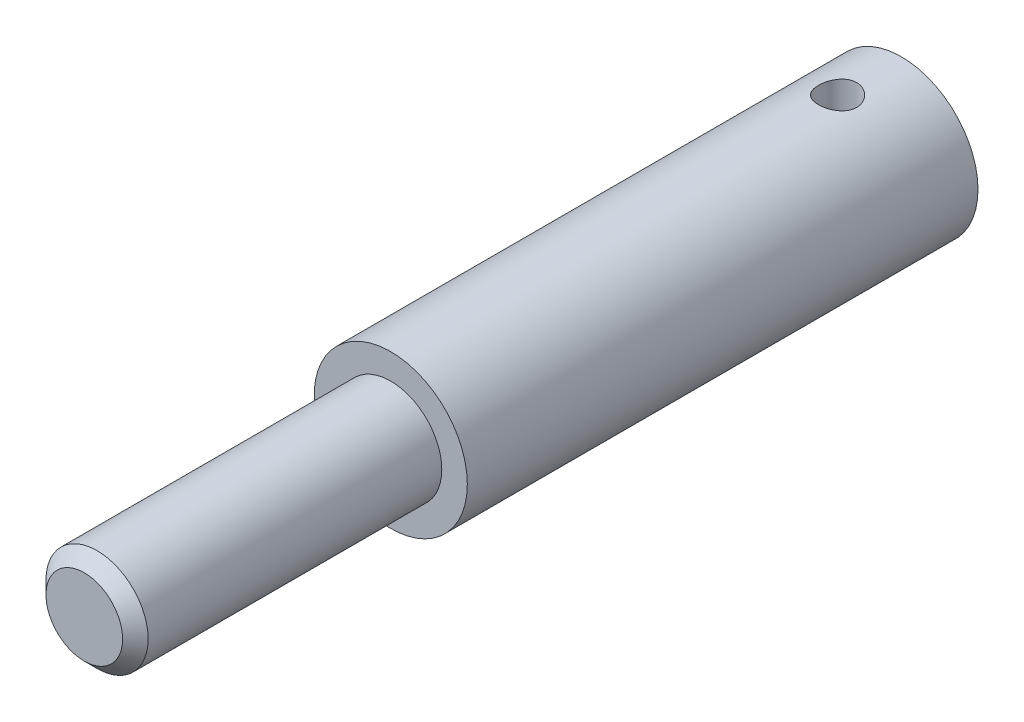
ISO-10303-21;
HEADER;
FILE_DESCRIPTION(('STEP AP214'),'2;1');
FILE_NAME('part.step','',(''),(''),'','','');
FILE_SCHEMA(('AUTOMOTIVE_DESIGN { 1 0 10303 214 1 1 1 1 }'));
ENDSEC;
DATA;
#1=APPLICATION_CONTEXT('core data for automotive mechanical design processes');
#2=APPLICATION_PROTOCOL_DEFINITION('international standard','automotive_design',2000,#1);
#3=PRODUCT_CONTEXT('',#1,'mechanical');
#4=PRODUCT('Part','Part','',(#3));
#5=PRODUCT_RELATED_PRODUCT_CATEGORY('part','',(#4));
#6=PRODUCT_DEFINITION_FORMATION('','',#4);
#7=PRODUCT_DEFINITION_CONTEXT('part definition',#1,'design');
#8=PRODUCT_DEFINITION('design','',#6,#7);
#9=PRODUCT_DEFINITION_SHAPE('','',#8);
#10=(LENGTH_UNIT() NAMED_UNIT(*) SI_UNIT(.MILLI.,.METRE.));
#11=(NAMED_UNIT(*) PLANE_ANGLE_UNIT() SI_UNIT($,.RADIAN.));
#12=(NAMED_UNIT(*) SI_UNIT($,.STERADIAN.) SOLID_ANGLE_UNIT());
#13=UNCERTAINTY_MEASURE_WITH_UNIT(LENGTH_MEASURE(1.E-05),#10,'distance_accuracy_value','');
#14=(GEOMETRIC_REPRESENTATION_CONTEXT(3) GLOBAL_UNCERTAINTY_ASSIGNED_CONTEXT((#13)) GLOBAL_UNIT_ASSIGNED_CONTEXT((#10,
#11,#12)) REPRESENTATION_CONTEXT('',''));
#15=CARTESIAN_POINT('',(0.,0.,0.));
#16=DIRECTION('',(0.,0.,1.));
#17=DIRECTION('',(1.,0.,0.));
#18=AXIS2_PLACEMENT_3D('',#15,#16,#17);
#19=CARTESIAN_POINT('',(0.,0.,40.));
#20=DIRECTION('',(0.,0.,1.));
#21=DIRECTION('',(1.,0.,0.));
#22=AXIS2_PLACEMENT_3D('',#19,#20,#21);
#23=PLANE('',#22);
#24=CARTESIAN_POINT('',(0.,0.,40.));
#25=DIRECTION('',(0.,0.,1.));
#26=DIRECTION('',(1.,0.,0.));
#27=AXIS2_PLACEMENT_3D('',#24,#25,#26);
#28=CIRCLE('',#27,6.);
#29=CARTESIAN_POINT('',(6.,0.,40.));
#30=VERTEX_POINT('',#29);
#31=EDGE_CURVE('E49',#30,#30,#28,.T.);
#32=ORIENTED_EDGE('',*,*,#31,.T.);
#33=EDGE_LOOP('',(#32));
#34=FACE_BOUND('',#33,.T.);
#35=CARTESIAN_POINT('',(0.,0.,40.));
#36=DIRECTION('',(0.,0.,1.));
#37=DIRECTION('',(1.,0.,0.));
#38=AXIS2_PLACEMENT_3D('',#35,#36,#37);
#39=CIRCLE('',#38,4.);
#40=CARTESIAN_POINT('',(4.,0.,40.));
#41=VERTEX_POINT('',#40);
#42=EDGE_CURVE('E85',#41,#41,#39,.T.);
#43=ORIENTED_EDGE('',*,*,#42,.F.);
#44=EDGE_LOOP('',(#43));
#45=FACE_BOUND('',#44,.T.);
#46=ADVANCED_FACE('F33',(#34,#45),#23,.T.);
#47=CARTESIAN_POINT('',(0.,0.,40.));
#48=DIRECTION('',(0.,0.,-1.));
#49=DIRECTION('',(-1.,0.,0.));
#50=AXIS2_PLACEMENT_3D('',#47,#48,#49);
#51=CYLINDRICAL_SURFACE('',#50,6.);
#52=CARTESIAN_POINT('',(0.,-6.,6.5));
#53=CARTESIAN_POINT('',(0.0828760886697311,-5.99999859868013,6.49999767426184));
#54=CARTESIAN_POINT('',(0.165778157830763,-5.99826578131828,6.49310844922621));
#55=CARTESIAN_POINT('',(0.329206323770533,-5.99152113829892,6.465774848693));
#56=CARTESIAN_POINT('',(0.409731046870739,-5.98650745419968,6.44532279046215));
#57=CARTESIAN_POINT('',(0.566020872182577,-5.9737562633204,6.39156074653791));
#58=CARTESIAN_POINT('',(0.641791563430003,-5.96602202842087,6.35826620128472));
#59=CARTESIAN_POINT('',(0.786672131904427,-5.94865343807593,6.27981860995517));
#60=CARTESIAN_POINT('',(0.855781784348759,-5.9390190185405,6.23466516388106));
#61=CARTESIAN_POINT('',(0.98680192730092,-5.91867413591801,6.13279921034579));
#62=CARTESIAN_POINT('',(1.04855569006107,-5.90794707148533,6.07588842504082));
#63=CARTESIAN_POINT('',(1.1617489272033,-5.8867362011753,5.95254779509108));
#64=CARTESIAN_POINT('',(1.21318723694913,-5.87625242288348,5.8861168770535));
#65=CARTESIAN_POINT('',(1.30502654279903,-5.8565477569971,5.74440477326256));
#66=CARTESIAN_POINT('',(1.34525221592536,-5.84734794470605,5.6690067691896));
#67=CARTESIAN_POINT('',(1.41239690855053,-5.83149494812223,5.51225158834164));
#68=CARTESIAN_POINT('',(1.43931805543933,-5.82484135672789,5.43089536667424));
#69=CARTESIAN_POINT('',(1.47855483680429,-5.81500476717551,5.26625650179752));
#70=CARTESIAN_POINT('',(1.49115226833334,-5.81175491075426,5.1830451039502));
#71=CARTESIAN_POINT('',(1.50226177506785,-5.80889362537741,5.01563143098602));
#72=CARTESIAN_POINT('',(1.50077614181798,-5.80928160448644,4.93142931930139));
#73=CARTESIAN_POINT('',(1.48398652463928,-5.81359205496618,4.76658419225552));
#74=CARTESIAN_POINT('',(1.46901834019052,-5.81742863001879,4.6859043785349));
#75=CARTESIAN_POINT('',(1.42622418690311,-5.82806709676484,4.52823894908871));
#76=CARTESIAN_POINT('',(1.39839730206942,-5.83486919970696,4.45125359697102));
#77=CARTESIAN_POINT('',(1.33038947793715,-5.85075113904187,4.30226198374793));
#78=CARTESIAN_POINT('',(1.29008666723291,-5.85985327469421,4.23031382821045));
#79=CARTESIAN_POINT('',(1.19835627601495,-5.87929710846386,4.09408129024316));
#80=CARTESIAN_POINT('',(1.14692674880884,-5.88963902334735,4.02979825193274));
#81=CARTESIAN_POINT('',(1.03266342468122,-5.91075880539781,3.9087963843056));
#82=CARTESIAN_POINT('',(0.96954625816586,-5.92154069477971,3.85234550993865));
#83=CARTESIAN_POINT('',(0.8346119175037,-5.94205965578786,3.7507787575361));
#84=CARTESIAN_POINT('',(0.762794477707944,-5.95179669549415,3.70566322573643));
#85=CARTESIAN_POINT('',(0.612115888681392,-5.96917732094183,3.62794941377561));
#86=CARTESIAN_POINT('',(0.533231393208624,-5.97681360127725,3.59539465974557));
#87=CARTESIAN_POINT('',(0.370876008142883,-5.98907916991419,3.54408269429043));
#88=CARTESIAN_POINT('',(0.287405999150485,-5.99370903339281,3.52532284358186));
#89=CARTESIAN_POINT('',(0.120539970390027,-5.99935499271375,3.50254243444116));
#90=CARTESIAN_POINT('',(0.0371967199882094,-6.00046053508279,3.4981569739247));
#91=CARTESIAN_POINT('',(-0.129032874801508,-5.99918804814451,3.50324900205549));
#92=CARTESIAN_POINT('',(-0.211919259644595,-5.99681033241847,3.51272524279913));
#93=CARTESIAN_POINT('',(-0.373614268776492,-5.98889581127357,3.54497090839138));
#94=CARTESIAN_POINT('',(-0.452465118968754,-5.98340634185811,3.56754126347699));
#95=CARTESIAN_POINT('',(-0.605257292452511,-5.96988706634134,3.62510708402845));
#96=CARTESIAN_POINT('',(-0.679198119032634,-5.96185700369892,3.66010380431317));
#97=CARTESIAN_POINT('',(-0.821523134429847,-5.94393307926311,3.74223612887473));
#98=CARTESIAN_POINT('',(-0.88978544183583,-5.93400867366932,3.78957611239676));
#99=CARTESIAN_POINT('',(-1.01752661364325,-5.91344509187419,3.89478990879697));
#100=CARTESIAN_POINT('',(-1.07700395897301,-5.90280579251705,3.95266553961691));
#101=CARTESIAN_POINT('',(-1.18699056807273,-5.88168956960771,4.07900196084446));
#102=CARTESIAN_POINT('',(-1.23724386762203,-5.87122304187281,4.14768770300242));
#103=CARTESIAN_POINT('',(-1.3255107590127,-5.85192878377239,4.29273263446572));
#104=CARTESIAN_POINT('',(-1.36352489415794,-5.84310098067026,4.36909148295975));
#105=CARTESIAN_POINT('',(-1.42595142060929,-5.82818094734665,4.52690572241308));
#106=CARTESIAN_POINT('',(-1.45044439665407,-5.82207255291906,4.60832762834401));
#107=CARTESIAN_POINT('',(-1.48534565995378,-5.81326744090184,4.77430963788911));
#108=CARTESIAN_POINT('',(-1.49575702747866,-5.81056997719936,4.85886905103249));
#109=CARTESIAN_POINT('',(-1.50203859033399,-5.80894901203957,5.0261210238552));
#110=CARTESIAN_POINT('',(-1.49831789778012,-5.80991932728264,5.10879743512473));
#111=CARTESIAN_POINT('',(-1.47737727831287,-5.81527909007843,5.27230388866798));
#112=CARTESIAN_POINT('',(-1.46015762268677,-5.81966846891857,5.35313396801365));
#113=CARTESIAN_POINT('',(-1.41293131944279,-5.83131260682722,5.51020845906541));
#114=CARTESIAN_POINT('',(-1.38300140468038,-5.83855015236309,5.58647730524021));
#115=CARTESIAN_POINT('',(-1.31126491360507,-5.85507755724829,5.73296538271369));
#116=CARTESIAN_POINT('',(-1.26945669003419,-5.86436770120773,5.80318377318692));
#117=CARTESIAN_POINT('',(-1.17386774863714,-5.88425634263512,5.93755462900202));
#118=CARTESIAN_POINT('',(-1.11980316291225,-5.89488264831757,6.00150107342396));
#119=CARTESIAN_POINT('',(-1.00178937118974,-5.91608027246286,6.11954704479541));
#120=CARTESIAN_POINT('',(-0.937837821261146,-5.9266515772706,6.17364423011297));
#121=CARTESIAN_POINT('',(-0.80046758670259,-5.94677655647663,6.27141130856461));
#122=CARTESIAN_POINT('',(-0.726898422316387,-5.95630833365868,6.31487461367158));
#123=CARTESIAN_POINT('',(-0.573266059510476,-5.97304924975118,6.38874746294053));
#124=CARTESIAN_POINT('',(-0.493207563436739,-5.98026005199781,6.41916636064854));
#125=CARTESIAN_POINT('',(-0.344410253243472,-5.99048059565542,6.46157183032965));
#126=CARTESIAN_POINT('',(-0.276380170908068,-5.99402585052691,6.47595124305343));
#127=CARTESIAN_POINT('',(-0.138906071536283,-5.99878605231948,6.49516594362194));
#128=CARTESIAN_POINT('',(-0.0694621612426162,-6.00000117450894,6.5000019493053));
#129=CARTESIAN_POINT('',(0.,-6.,6.5));
#130=B_SPLINE_CURVE_WITH_KNOTS('',3,(#52,#53,#54,#55,#56,#57,#58,#59,#60,#61,#62,#63,#64,#65,
#66,#67,#68,#69,#70,#71,#72,#73,#74,#75,#76,#77,#78,#79,#80,#81,#82,#83,#84,#85,#86,#87,#88,#89,
#90,#91,#92,#93,#94,#95,#96,#97,#98,#99,#100,#101,#102,#103,#104,#105,#106,#107,#108,#109,#110,
#111,#112,#113,#114,#115,#116,#117,#118,#119,#120,#121,#122,#123,#124,#125,#126,#127,#128,#129),
.UNSPECIFIED.,.T.,.F.,(4,2,2,2,2,2,2,2,2,2,2,2,2,2,2,2,2,2,2,2,2,2,2,2,2,2,2,2,2,2,2,2,2,2,2,2,
2,2,4),(0.,0.24837371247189,0.4968882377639,0.745104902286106,0.993329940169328,
1.24614435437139,1.49898729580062,1.75558647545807,2.01214461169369,2.2635629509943,
2.51494038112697,2.76022497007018,3.00552703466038,3.25330527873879,3.50112690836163,
3.75601500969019,4.01091089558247,4.26668229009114,4.52240473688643,4.77158308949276,
5.02073901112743,5.26620274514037,5.5116912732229,5.76153587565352,6.01142363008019,
6.26744509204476,6.52345518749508,6.77792254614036,7.03233423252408,7.27943780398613,
7.52653640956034,7.77216400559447,8.01782568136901,8.2698957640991,8.52202569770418,
8.77872185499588,9.0352336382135,9.24342242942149,9.4515955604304),.UNSPECIFIED.);
#131=CARTESIAN_POINT('',(0.,-6.,6.5));
#132=VERTEX_POINT('',#131);
#133=EDGE_CURVE('E37',#132,#132,#130,.T.);
#134=ORIENTED_EDGE('',*,*,#133,.T.);
#135=EDGE_LOOP('',(#134));
#136=FACE_BOUND('',#135,.T.);
#137=CARTESIAN_POINT('',(0.,6.,6.5));
#138=CARTESIAN_POINT('',(-0.0828760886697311,5.99999859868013,6.49999767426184));
#139=CARTESIAN_POINT('',(-0.165778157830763,5.99826578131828,6.49310844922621));
#140=CARTESIAN_POINT('',(-0.329206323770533,5.99152113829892,6.465774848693));
#141=CARTESIAN_POINT('',(-0.409731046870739,5.98650745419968,6.44532279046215));
#142=CARTESIAN_POINT('',(-0.566020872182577,5.9737562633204,6.39156074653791));
#143=CARTESIAN_POINT('',(-0.641791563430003,5.96602202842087,6.35826620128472));
#144=CARTESIAN_POINT('',(-0.786672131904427,5.94865343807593,6.27981860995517));
#145=CARTESIAN_POINT('',(-0.855781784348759,5.9390190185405,6.23466516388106));
#146=CARTESIAN_POINT('',(-0.98680192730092,5.91867413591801,6.13279921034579));
#147=CARTESIAN_POINT('',(-1.04855569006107,5.90794707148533,6.07588842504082));
#148=CARTESIAN_POINT('',(-1.1617489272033,5.8867362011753,5.95254779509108));
#149=CARTESIAN_POINT('',(-1.21318723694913,5.87625242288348,5.8861168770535));
#150=CARTESIAN_POINT('',(-1.30502654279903,5.8565477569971,5.74440477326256));
#151=CARTESIAN_POINT('',(-1.34525221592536,5.84734794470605,5.6690067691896));
#152=CARTESIAN_POINT('',(-1.41239690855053,5.83149494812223,5.51225158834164));
#153=CARTESIAN_POINT('',(-1.43931805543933,5.82484135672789,5.43089536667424));
#154=CARTESIAN_POINT('',(-1.47855483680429,5.81500476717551,5.26625650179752));
#155=CARTESIAN_POINT('',(-1.49115226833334,5.81175491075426,5.1830451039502));
#156=CARTESIAN_POINT('',(-1.50226177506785,5.80889362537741,5.01563143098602));
#157=CARTESIAN_POINT('',(-1.50077614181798,5.80928160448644,4.93142931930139));
#158=CARTESIAN_POINT('',(-1.48398652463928,5.81359205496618,4.76658419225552));
#159=CARTESIAN_POINT('',(-1.46901834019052,5.81742863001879,4.6859043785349));
#160=CARTESIAN_POINT('',(-1.42622418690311,5.82806709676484,4.52823894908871));
#161=CARTESIAN_POINT('',(-1.39839730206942,5.83486919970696,4.45125359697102));
#162=CARTESIAN_POINT('',(-1.33038947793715,5.85075113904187,4.30226198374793));
#163=CARTESIAN_POINT('',(-1.29008666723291,5.85985327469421,4.23031382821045));
#164=CARTESIAN_POINT('',(-1.19835627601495,5.87929710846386,4.09408129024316));
#165=CARTESIAN_POINT('',(-1.14692674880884,5.88963902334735,4.02979825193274));
#166=CARTESIAN_POINT('',(-1.03266342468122,5.91075880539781,3.9087963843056));
#167=CARTESIAN_POINT('',(-0.96954625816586,5.92154069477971,3.85234550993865));
#168=CARTESIAN_POINT('',(-0.8346119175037,5.94205965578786,3.7507787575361));
#169=CARTESIAN_POINT('',(-0.762794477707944,5.95179669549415,3.70566322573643));
#170=CARTESIAN_POINT('',(-0.612115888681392,5.96917732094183,3.62794941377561));
#171=CARTESIAN_POINT('',(-0.533231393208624,5.97681360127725,3.59539465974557));
#172=CARTESIAN_POINT('',(-0.370876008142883,5.98907916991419,3.54408269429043));
#173=CARTESIAN_POINT('',(-0.287405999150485,5.99370903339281,3.52532284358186));
#174=CARTESIAN_POINT('',(-0.120539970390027,5.99935499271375,3.50254243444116));
#175=CARTESIAN_POINT('',(-0.0371967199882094,6.00046053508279,3.4981569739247));
#176=CARTESIAN_POINT('',(0.129032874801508,5.99918804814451,3.50324900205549));
#177=CARTESIAN_POINT('',(0.211919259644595,5.99681033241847,3.51272524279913));
#178=CARTESIAN_POINT('',(0.373614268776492,5.98889581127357,3.54497090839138));
#179=CARTESIAN_POINT('',(0.452465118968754,5.98340634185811,3.56754126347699));
#180=CARTESIAN_POINT('',(0.605257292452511,5.96988706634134,3.62510708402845));
#181=CARTESIAN_POINT('',(0.679198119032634,5.96185700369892,3.66010380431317));
#182=CARTESIAN_POINT('',(0.821523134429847,5.94393307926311,3.74223612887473));
#183=CARTESIAN_POINT('',(0.88978544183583,5.93400867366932,3.78957611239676));
#184=CARTESIAN_POINT('',(1.01752661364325,5.91344509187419,3.89478990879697));
#185=CARTESIAN_POINT('',(1.07700395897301,5.90280579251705,3.95266553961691));
#186=CARTESIAN_POINT('',(1.18699056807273,5.88168956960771,4.07900196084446));
#187=CARTESIAN_POINT('',(1.23724386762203,5.87122304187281,4.14768770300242));
#188=CARTESIAN_POINT('',(1.3255107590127,5.85192878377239,4.29273263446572));
#189=CARTESIAN_POINT('',(1.36352489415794,5.84310098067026,4.36909148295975));
#190=CARTESIAN_POINT('',(1.42595142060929,5.82818094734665,4.52690572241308));
#191=CARTESIAN_POINT('',(1.45044439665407,5.82207255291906,4.60832762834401));
#192=CARTESIAN_POINT('',(1.48534565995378,5.81326744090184,4.77430963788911));
#193=CARTESIAN_POINT('',(1.49575702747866,5.81056997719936,4.85886905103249));
#194=CARTESIAN_POINT('',(1.50203859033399,5.80894901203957,5.0261210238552));
#195=CARTESIAN_POINT('',(1.49831789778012,5.80991932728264,5.10879743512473));
#196=CARTESIAN_POINT('',(1.47737727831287,5.81527909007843,5.27230388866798));
#197=CARTESIAN_POINT('',(1.46015762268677,5.81966846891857,5.35313396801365));
#198=CARTESIAN_POINT('',(1.41293131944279,5.83131260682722,5.51020845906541));
#199=CARTESIAN_POINT('',(1.38300140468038,5.83855015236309,5.58647730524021));
#200=CARTESIAN_POINT('',(1.31126491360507,5.85507755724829,5.73296538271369));
#201=CARTESIAN_POINT('',(1.26945669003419,5.86436770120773,5.80318377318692));
#202=CARTESIAN_POINT('',(1.17386774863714,5.88425634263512,5.93755462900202));
#203=CARTESIAN_POINT('',(1.11980316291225,5.89488264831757,6.00150107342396));
#204=CARTESIAN_POINT('',(1.00178937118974,5.91608027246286,6.11954704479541));
#205=CARTESIAN_POINT('',(0.937837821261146,5.9266515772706,6.17364423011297));
#206=CARTESIAN_POINT('',(0.80046758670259,5.94677655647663,6.27141130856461));
#207=CARTESIAN_POINT('',(0.726898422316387,5.95630833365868,6.31487461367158));
#208=CARTESIAN_POINT('',(0.573266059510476,5.97304924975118,6.38874746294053));
#209=CARTESIAN_POINT('',(0.493207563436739,5.98026005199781,6.41916636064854));
#210=CARTESIAN_POINT('',(0.344410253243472,5.99048059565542,6.46157183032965));
#211=CARTESIAN_POINT('',(0.276380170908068,5.99402585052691,6.47595124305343));
#212=CARTESIAN_POINT('',(0.138906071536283,5.99878605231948,6.49516594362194));
#213=CARTESIAN_POINT('',(0.0694621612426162,6.00000117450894,6.5000019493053));
#214=CARTESIAN_POINT('',(0.,6.,6.5));
#215=B_SPLINE_CURVE_WITH_KNOTS('',3,(#137,#138,#139,#140,#141,#142,#143,#144,#145,#146,#147,
#148,#149,#150,#151,#152,#153,#154,#155,#156,#157,#158,#159,#160,#161,#162,#163,#164,#165,#166,
#167,#168,#169,#170,#171,#172,#173,#174,#175,#176,#177,#178,#179,#180,#181,#182,#183,#184,#185,
#186,#187,#188,#189,#190,#191,#192,#193,#194,#195,#196,#197,#198,#199,#200,#201,#202,#203,#204,
#205,#206,#207,#208,#209,#210,#211,#212,#213,#214),.UNSPECIFIED.,.T.,.F.,(4,2,2,2,2,2,2,2,2,2,2,
2,2,2,2,2,2,2,2,2,2,2,2,2,2,2,2,2,2,2,2,2,2,2,2,2,2,2,4),(0.,0.24837371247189,0.4968882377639,
0.745104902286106,0.993329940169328,1.24614435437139,1.49898729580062,1.75558647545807,
2.01214461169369,2.2635629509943,2.51494038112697,2.76022497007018,3.00552703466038,
3.25330527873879,3.50112690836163,3.75601500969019,4.01091089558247,4.26668229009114,
4.52240473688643,4.77158308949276,5.02073901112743,5.26620274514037,5.5116912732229,
5.76153587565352,6.01142363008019,6.26744509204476,6.52345518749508,6.77792254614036,
7.03233423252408,7.27943780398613,7.52653640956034,7.77216400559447,8.01782568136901,
8.2698957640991,8.52202569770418,8.77872185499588,9.0352336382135,9.24342242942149,
9.4515955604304),.UNSPECIFIED.);
#216=CARTESIAN_POINT('',(0.,6.,6.5));
#217=VERTEX_POINT('',#216);
#218=EDGE_CURVE('E52',#217,#217,#215,.T.);
#219=ORIENTED_EDGE('',*,*,#218,.T.);
#220=EDGE_LOOP('',(#219));
#221=FACE_BOUND('',#220,.T.);
#222=ORIENTED_EDGE('',*,*,#31,.F.);
#223=EDGE_LOOP('',(#222));
#224=FACE_BOUND('',#223,.T.);
#225=CARTESIAN_POINT('',(0.,0.,0.));
#226=DIRECTION('',(0.,0.,1.));
#227=DIRECTION('',(1.,0.,0.));
#228=AXIS2_PLACEMENT_3D('',#225,#226,#227);
#229=CIRCLE('',#228,6.);
#230=CARTESIAN_POINT('',(6.,0.,0.));
#231=VERTEX_POINT('',#230);
#232=EDGE_CURVE('E83',#231,#231,#229,.T.);
#233=ORIENTED_EDGE('',*,*,#232,.T.);
#234=EDGE_LOOP('',(#233));
#235=FACE_BOUND('',#234,.T.);
#236=ADVANCED_FACE('F56',(#136,#221,#224,#235),#51,.T.);
#237=CARTESIAN_POINT('',(0.,0.,0.));
#238=DIRECTION('',(0.,0.,1.));
#239=DIRECTION('',(1.,0.,0.));
#240=AXIS2_PLACEMENT_3D('',#237,#238,#239);
#241=PLANE('',#240);
#242=ORIENTED_EDGE('',*,*,#232,.F.);
#243=EDGE_LOOP('',(#242));
#244=FACE_BOUND('',#243,.T.);
#245=ADVANCED_FACE('F72',(#244),#241,.F.);
#246=CARTESIAN_POINT('',(0.,0.,64.));
#247=DIRECTION('',(0.,0.,-1.));
#248=DIRECTION('',(-1.,0.,0.));
#249=AXIS2_PLACEMENT_3D('',#246,#247,#248);
#250=CYLINDRICAL_SURFACE('',#249,4.);
#251=CARTESIAN_POINT('',(0.,0.,63.));
#252=DIRECTION('',(0.,0.,1.));
#253=DIRECTION('',(1.,0.,0.));
#254=AXIS2_PLACEMENT_3D('',#251,#252,#253);
#255=CIRCLE('',#254,4.);
#256=CARTESIAN_POINT('',(4.,0.,63.));
#257=VERTEX_POINT('',#256);
#258=EDGE_CURVE('E10',#257,#257,#255,.F.);
#259=ORIENTED_EDGE('',*,*,#258,.T.);
#260=EDGE_LOOP('',(#259));
#261=FACE_BOUND('',#260,.T.);
#262=ORIENTED_EDGE('',*,*,#42,.T.);
#263=EDGE_LOOP('',(#262));
#264=FACE_BOUND('',#263,.T.);
#265=ADVANCED_FACE('F68',(#261,#264),#250,.T.);
#266=CARTESIAN_POINT('',(0.,0.,64.));
#267=DIRECTION('',(0.,0.,1.));
#268=DIRECTION('',(1.,0.,0.));
#269=AXIS2_PLACEMENT_3D('',#266,#267,#268);
#270=PLANE('',#269);
#271=CARTESIAN_POINT('',(0.,0.,64.));
#272=DIRECTION('',(0.,0.,1.));
#273=DIRECTION('',(1.,0.,0.));
#274=AXIS2_PLACEMENT_3D('',#271,#272,#273);
#275=CIRCLE('',#274,3.);
#276=CARTESIAN_POINT('',(3.,0.,64.));
#277=VERTEX_POINT('',#276);
#278=EDGE_CURVE('E44',#277,#277,#275,.T.);
#279=ORIENTED_EDGE('',*,*,#278,.T.);
#280=EDGE_LOOP('',(#279));
#281=FACE_BOUND('',#280,.T.);
#282=ADVANCED_FACE('F64',(#281),#270,.T.);
#283=CARTESIAN_POINT('',(0.,0.,64.));
#284=DIRECTION('',(0.,0.,-1.));
#285=DIRECTION('',(-1.,0.,0.));
#286=AXIS2_PLACEMENT_3D('',#283,#284,#285);
#287=CONICAL_SURFACE('',#286,3.,0.785398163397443);
#288=ORIENTED_EDGE('',*,*,#258,.F.);
#289=EDGE_LOOP('',(#288));
#290=FACE_BOUND('',#289,.T.);
#291=ORIENTED_EDGE('',*,*,#278,.F.);
#292=EDGE_LOOP('',(#291));
#293=FACE_BOUND('',#292,.T.);
#294=ADVANCED_FACE('F35',(#290,#293),#287,.T.);
#295=CARTESIAN_POINT('',(0.,-11.,5.));
#296=DIRECTION('',(0.,1.,0.));
#297=DIRECTION('',(0.,0.,1.));
#298=AXIS2_PLACEMENT_3D('',#295,#296,#297);
#299=CYLINDRICAL_SURFACE('',#298,1.5);
#300=ORIENTED_EDGE('',*,*,#218,.F.);
#301=EDGE_LOOP('',(#300));
#302=FACE_BOUND('',#301,.T.);
#303=ORIENTED_EDGE('',*,*,#133,.F.);
#304=EDGE_LOOP('',(#303));
#305=FACE_BOUND('',#304,.T.);
#306=ADVANCED_FACE('F59',(#302,#305),#299,.F.);
#307=CLOSED_SHELL('',(#46,#236,#245,#265,#282,#294,#306));
#308=MANIFOLD_SOLID_BREP('B2',#307);
#309=ADVANCED_BREP_SHAPE_REPRESENTATION('',(#18,#308),#14);
#310=SHAPE_DEFINITION_REPRESENTATION(#9,#309);
ENDSEC;
END-ISO-10303-21;
